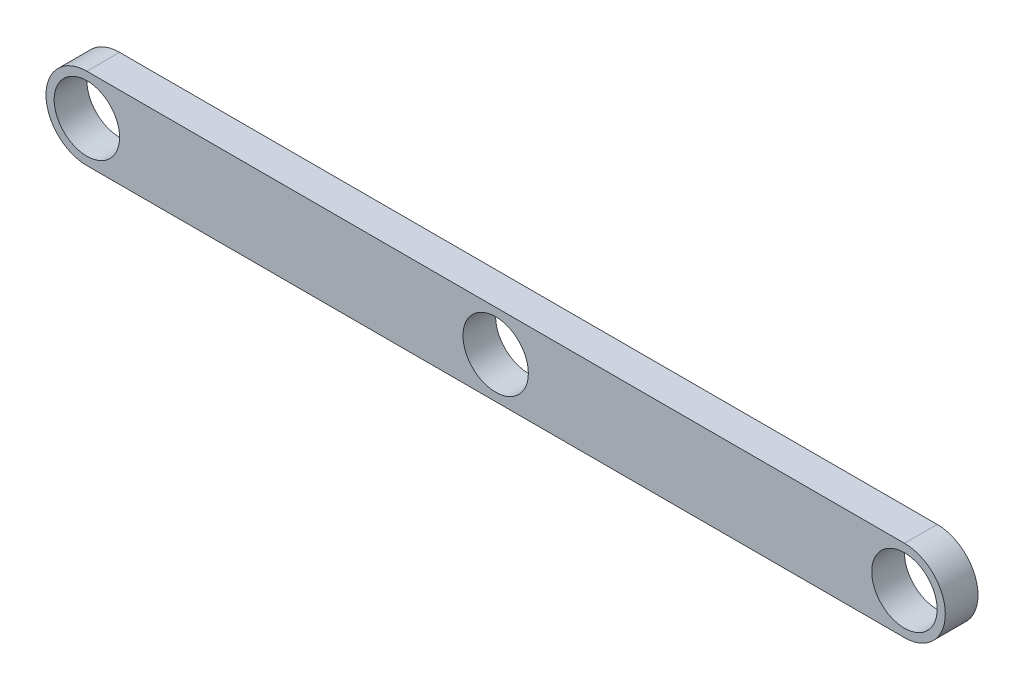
from build123d import *

# Parameters (mm, degrees)
SKETCH1_R          = 50.8
BASE_EXTRUDE_DEPTH = 50.8


with BuildPart() as part:
    # Sketch1 → Base-Extrude (new body)
    with BuildSketch(Plane.XY):
        with BuildLine():
            Line((1275.040466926, 0), (5.040466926, 0))
            ThreePointArc((5.040466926, 0), (-58.459533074, 63.5), (5.040466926, 127))
            Line((5.040466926, 127), (1275.040466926, 127))
            ThreePointArc((1275.040466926, 127), (1338.540466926, 63.5), (1275.040466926, 0))
        make_face()
        with Locations((1275.040466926, 63.5)):
            Circle(SKETCH1_R, mode=Mode.SUBTRACT)
        with Locations((5.040466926, 63.5)):
            Circle(SKETCH1_R, mode=Mode.SUBTRACT)
        with Locations((640.040466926, 63.5)):
            Circle(SKETCH1_R, mode=Mode.SUBTRACT)
    extrude(amount=-BASE_EXTRUDE_DEPTH)


solid = part.part
